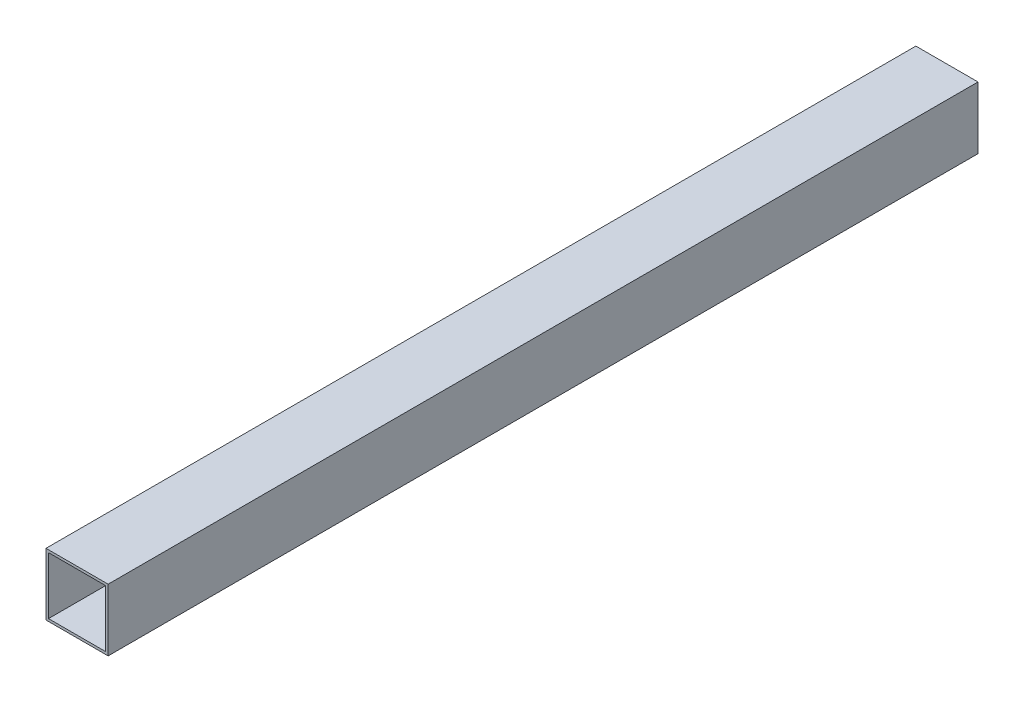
from build123d import *

# Parameters (mm, degrees)
SCHIZZO1_W                = 25
SCHIZZO1_H                = 25
SCHIZZO1_W_2              = 23
SCHIZZO1_H_2              = 23
ESTRUSIONE_SOTTILE1_DEPTH = 350


with BuildPart() as part:
    # Schizzo1 → Estrusione-Sottile1 (new body)
    with BuildSketch(Plane.XY):
        Rectangle(SCHIZZO1_W, SCHIZZO1_H)
        Rectangle(SCHIZZO1_W_2, SCHIZZO1_H_2, mode=Mode.SUBTRACT)
    extrude(amount=ESTRUSIONE_SOTTILE1_DEPTH)


solid = part.part
